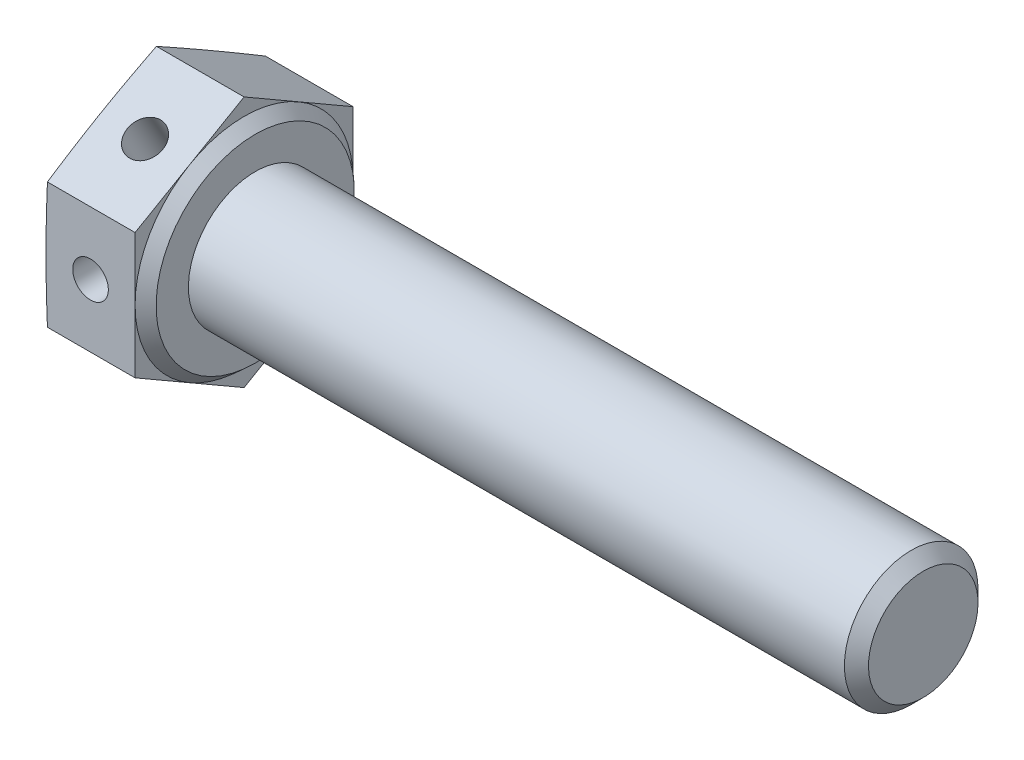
ISO-10303-21;
HEADER;
FILE_DESCRIPTION(('STEP AP214'),'2;1');
FILE_NAME('part.step','',(''),(''),'','','');
FILE_SCHEMA(('AUTOMOTIVE_DESIGN { 1 0 10303 214 1 1 1 1 }'));
ENDSEC;
DATA;
#1=APPLICATION_CONTEXT('core data for automotive mechanical design processes');
#2=APPLICATION_PROTOCOL_DEFINITION('international standard','automotive_design',2000,#1);
#3=PRODUCT_CONTEXT('',#1,'mechanical');
#4=PRODUCT('Part','Part','',(#3));
#5=PRODUCT_RELATED_PRODUCT_CATEGORY('part','',(#4));
#6=PRODUCT_DEFINITION_FORMATION('','',#4);
#7=PRODUCT_DEFINITION_CONTEXT('part definition',#1,'design');
#8=PRODUCT_DEFINITION('design','',#6,#7);
#9=PRODUCT_DEFINITION_SHAPE('','',#8);
#10=(LENGTH_UNIT() NAMED_UNIT(*) SI_UNIT(.MILLI.,.METRE.));
#11=(NAMED_UNIT(*) PLANE_ANGLE_UNIT() SI_UNIT($,.RADIAN.));
#12=(NAMED_UNIT(*) SI_UNIT($,.STERADIAN.) SOLID_ANGLE_UNIT());
#13=UNCERTAINTY_MEASURE_WITH_UNIT(LENGTH_MEASURE(1.E-05),#10,'distance_accuracy_value','');
#14=(GEOMETRIC_REPRESENTATION_CONTEXT(3) GLOBAL_UNCERTAINTY_ASSIGNED_CONTEXT((#13)) GLOBAL_UNIT_ASSIGNED_CONTEXT((#10,
#11,#12)) REPRESENTATION_CONTEXT('',''));
#15=CARTESIAN_POINT('',(0.,0.,0.));
#16=DIRECTION('',(0.,0.,1.));
#17=DIRECTION('',(1.,0.,0.));
#18=AXIS2_PLACEMENT_3D('',#15,#16,#17);
#19=CARTESIAN_POINT('',(2.,0.,-4.895));
#20=DIRECTION('',(0.,0.,1.));
#21=DIRECTION('',(1.,0.,0.));
#22=AXIS2_PLACEMENT_3D('',#19,#20,#21);
#23=CYLINDRICAL_SURFACE('',#22,0.8);
#24=CARTESIAN_POINT('',(2.,0.,4.895));
#25=DIRECTION('',(0.,0.,1.));
#26=DIRECTION('',(1.,0.,0.));
#27=AXIS2_PLACEMENT_3D('',#24,#25,#26);
#28=CIRCLE('',#27,0.8);
#29=CARTESIAN_POINT('',(2.8,0.,4.895));
#30=VERTEX_POINT('',#29);
#31=EDGE_CURVE('E385',#30,#30,#28,.T.);
#32=ORIENTED_EDGE('',*,*,#31,.T.);
#33=EDGE_LOOP('',(#32));
#34=FACE_BOUND('',#33,.T.);
#35=CARTESIAN_POINT('',(2.,0.,0.));
#36=DIRECTION('',(0.,-0.866025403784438,0.500000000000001));
#37=DIRECTION('',(0.,0.500000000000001,0.866025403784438));
#38=AXIS2_PLACEMENT_3D('',#35,#36,#37);
#39=ELLIPSE('',#38,1.6,0.8);
#40=CARTESIAN_POINT('',(1.2,0.,0.));
#41=VERTEX_POINT('',#40);
#42=CARTESIAN_POINT('',(2.8,0.,0.));
#43=VERTEX_POINT('',#42);
#44=EDGE_CURVE('E50',#41,#43,#39,.F.);
#45=ORIENTED_EDGE('',*,*,#44,.T.);
#46=CARTESIAN_POINT('',(2.,0.,0.));
#47=DIRECTION('',(0.,0.500000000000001,0.866025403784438));
#48=DIRECTION('',(0.,-0.866025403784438,0.500000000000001));
#49=AXIS2_PLACEMENT_3D('',#46,#47,#48);
#50=ELLIPSE('',#49,0.923760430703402,0.8);
#51=EDGE_CURVE('E11',#43,#41,#50,.F.);
#52=ORIENTED_EDGE('',*,*,#51,.T.);
#53=EDGE_LOOP('',(#45,#52));
#54=FACE_BOUND('',#53,.T.);
#55=ADVANCED_FACE('F37',(#34,#54),#23,.F.);
#56=CARTESIAN_POINT('',(4.5,0.,0.));
#57=DIRECTION('',(-1.,0.,0.));
#58=DIRECTION('',(0.,-1.,0.));
#59=AXIS2_PLACEMENT_3D('',#56,#57,#58);
#60=PLANE('',#59);
#61=CARTESIAN_POINT('',(4.5,0.,0.));
#62=DIRECTION('',(-1.,0.,0.));
#63=DIRECTION('',(0.,-1.,0.));
#64=AXIS2_PLACEMENT_3D('',#61,#62,#63);
#65=CIRCLE('',#64,4.45);
#66=CARTESIAN_POINT('',(4.5,-4.44999999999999,0.));
#67=VERTEX_POINT('',#66);
#68=EDGE_CURVE('E376',#67,#67,#65,.T.);
#69=ORIENTED_EDGE('',*,*,#68,.F.);
#70=EDGE_LOOP('',(#69));
#71=FACE_BOUND('',#70,.T.);
#72=CARTESIAN_POINT('',(4.5,0.,0.));
#73=DIRECTION('',(-1.,0.,0.));
#74=DIRECTION('',(0.,-1.,0.));
#75=AXIS2_PLACEMENT_3D('',#72,#73,#74);
#76=CIRCLE('',#75,3.);
#77=CARTESIAN_POINT('',(4.5,-3.,0.));
#78=VERTEX_POINT('',#77);
#79=EDGE_CURVE('E151',#78,#78,#76,.F.);
#80=ORIENTED_EDGE('',*,*,#79,.F.);
#81=EDGE_LOOP('',(#80));
#82=FACE_BOUND('',#81,.T.);
#83=ADVANCED_FACE('F332',(#71,#82),#60,.F.);
#84=CARTESIAN_POINT('',(4.,0.,9.79));
#85=DIRECTION('',(-1.,0.,0.));
#86=DIRECTION('',(0.,0.,1.));
#87=AXIS2_PLACEMENT_3D('',#84,#85,#86);
#88=PLANE('',#87);
#89=DIRECTION('',(0.,-0.5,-0.866025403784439));
#90=VECTOR('',#89,1.);
#91=CARTESIAN_POINT('',(4.,-2.82612956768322,4.895));
#92=LINE('',#91,#90);
#93=CARTESIAN_POINT('',(4.,-2.82612956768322,4.895));
#94=VERTEX_POINT('',#93);
#95=CARTESIAN_POINT('',(4.,-4.23919435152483,2.4475));
#96=VERTEX_POINT('',#95);
#97=EDGE_CURVE('E199',#94,#96,#92,.T.);
#98=ORIENTED_EDGE('',*,*,#97,.T.);
#99=CARTESIAN_POINT('',(4.,0.,0.));
#100=DIRECTION('',(-1.,0.,0.));
#101=DIRECTION('',(0.,-1.,0.));
#102=AXIS2_PLACEMENT_3D('',#99,#100,#101);
#103=CIRCLE('',#102,4.895);
#104=CARTESIAN_POINT('',(4.,0.,4.895));
#105=VERTEX_POINT('',#104);
#106=EDGE_CURVE('E58',#96,#105,#103,.T.);
#107=ORIENTED_EDGE('',*,*,#106,.T.);
#108=DIRECTION('',(0.,-1.,0.));
#109=VECTOR('',#108,1.);
#110=CARTESIAN_POINT('',(4.,2.82612956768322,4.895));
#111=LINE('',#110,#109);
#112=EDGE_CURVE('E182',#105,#94,#111,.T.);
#113=ORIENTED_EDGE('',*,*,#112,.T.);
#114=EDGE_LOOP('',(#98,#107,#113));
#115=FACE_BOUND('',#114,.T.);
#116=ADVANCED_FACE('F338',(#115),#88,.F.);
#117=CARTESIAN_POINT('',(4.,2.82612956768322,4.895));
#118=VERTEX_POINT('',#117);
#119=EDGE_CURVE('E179',#118,#105,#111,.T.);
#120=ORIENTED_EDGE('',*,*,#119,.T.);
#121=CARTESIAN_POINT('',(4.,4.23919435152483,2.4475));
#122=VERTEX_POINT('',#121);
#123=EDGE_CURVE('E154',#105,#122,#103,.T.);
#124=ORIENTED_EDGE('',*,*,#123,.T.);
#125=DIRECTION('',(0.,-0.5,0.866025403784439));
#126=VECTOR('',#125,1.);
#127=CARTESIAN_POINT('',(4.,5.65225913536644,0.));
#128=LINE('',#127,#126);
#129=EDGE_CURVE('E186',#122,#118,#128,.T.);
#130=ORIENTED_EDGE('',*,*,#129,.T.);
#131=EDGE_LOOP('',(#120,#124,#130));
#132=FACE_BOUND('',#131,.T.);
#133=ADVANCED_FACE('F508',(#132),#88,.F.);
#134=CARTESIAN_POINT('',(4.,5.65225913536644,0.));
#135=VERTEX_POINT('',#134);
#136=EDGE_CURVE('E183',#135,#122,#128,.T.);
#137=ORIENTED_EDGE('',*,*,#136,.T.);
#138=CARTESIAN_POINT('',(4.,4.23919435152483,-2.4475));
#139=VERTEX_POINT('',#138);
#140=EDGE_CURVE('E579',#122,#139,#103,.T.);
#141=ORIENTED_EDGE('',*,*,#140,.T.);
#142=DIRECTION('',(0.,0.5,0.866025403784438));
#143=VECTOR('',#142,1.);
#144=CARTESIAN_POINT('',(4.,2.82612956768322,-4.895));
#145=LINE('',#144,#143);
#146=EDGE_CURVE('E190',#139,#135,#145,.T.);
#147=ORIENTED_EDGE('',*,*,#146,.T.);
#148=EDGE_LOOP('',(#137,#141,#147));
#149=FACE_BOUND('',#148,.T.);
#150=ADVANCED_FACE('F499',(#149),#88,.F.);
#151=CARTESIAN_POINT('',(4.,2.82612956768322,-4.895));
#152=VERTEX_POINT('',#151);
#153=EDGE_CURVE('E187',#152,#139,#145,.T.);
#154=ORIENTED_EDGE('',*,*,#153,.T.);
#155=CARTESIAN_POINT('',(4.,0.,-4.895));
#156=VERTEX_POINT('',#155);
#157=EDGE_CURVE('E577',#139,#156,#103,.T.);
#158=ORIENTED_EDGE('',*,*,#157,.T.);
#159=DIRECTION('',(0.,1.,0.));
#160=VECTOR('',#159,1.);
#161=CARTESIAN_POINT('',(4.,-2.82612956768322,-4.895));
#162=LINE('',#161,#160);
#163=EDGE_CURVE('E194',#156,#152,#162,.T.);
#164=ORIENTED_EDGE('',*,*,#163,.T.);
#165=EDGE_LOOP('',(#154,#158,#164));
#166=FACE_BOUND('',#165,.T.);
#167=ADVANCED_FACE('F489',(#166),#88,.F.);
#168=CARTESIAN_POINT('',(4.,-2.82612956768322,-4.895));
#169=VERTEX_POINT('',#168);
#170=EDGE_CURVE('E191',#169,#156,#162,.T.);
#171=ORIENTED_EDGE('',*,*,#170,.T.);
#172=CARTESIAN_POINT('',(4.,-4.23919435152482,-2.4475));
#173=VERTEX_POINT('',#172);
#174=EDGE_CURVE('E576',#156,#173,#103,.T.);
#175=ORIENTED_EDGE('',*,*,#174,.T.);
#176=DIRECTION('',(0.,0.5,-0.866025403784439));
#177=VECTOR('',#176,1.);
#178=CARTESIAN_POINT('',(4.,-5.65225913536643,0.));
#179=LINE('',#178,#177);
#180=EDGE_CURVE('E198',#173,#169,#179,.T.);
#181=ORIENTED_EDGE('',*,*,#180,.T.);
#182=EDGE_LOOP('',(#171,#175,#181));
#183=FACE_BOUND('',#182,.T.);
#184=ADVANCED_FACE('F239',(#183),#88,.F.);
#185=CARTESIAN_POINT('',(4.,-2.82612956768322,4.895));
#186=DIRECTION('',(0.,0.866025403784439,-0.5));
#187=DIRECTION('',(0.,0.5,0.866025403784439));
#188=AXIS2_PLACEMENT_3D('',#185,#186,#187);
#189=PLANE('',#188);
#190=CARTESIAN_POINT('',(0.0648633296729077,-5.65237460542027,-0.000199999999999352));
#191=CARTESIAN_POINT('',(0.0547762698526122,-5.53465016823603,0.203704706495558));
#192=CARTESIAN_POINT('',(0.0456389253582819,-5.41690358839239,0.407647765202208));
#193=CARTESIAN_POINT('',(0.0296091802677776,-5.18136784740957,0.815607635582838));
#194=CARTESIAN_POINT('',(0.0227168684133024,-5.06357868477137,1.0196244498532));
#195=CARTESIAN_POINT('',(0.0115265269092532,-4.82803136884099,1.42760436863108));
#196=CARTESIAN_POINT('',(0.00722712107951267,-4.71027323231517,1.63156744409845));
#197=CARTESIAN_POINT('',(0.00146388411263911,-4.47474151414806,2.03952034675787));
#198=CARTESIAN_POINT('',(0.,-4.35696793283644,2.24351017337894));
#199=CARTESIAN_POINT('',(0.,-4.12142077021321,2.65148982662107));
#200=CARTESIAN_POINT('',(0.00146388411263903,-4.00364718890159,2.85547965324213));
#201=CARTESIAN_POINT('',(0.00722712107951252,-3.76811547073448,3.26343255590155));
#202=CARTESIAN_POINT('',(0.011526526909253,-3.65035733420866,3.46739563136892));
#203=CARTESIAN_POINT('',(0.0227168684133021,-3.41481001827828,3.8753755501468));
#204=CARTESIAN_POINT('',(0.0296091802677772,-3.29702085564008,4.07939236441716));
#205=CARTESIAN_POINT('',(0.0456389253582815,-3.06148511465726,4.48735223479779));
#206=CARTESIAN_POINT('',(0.0547762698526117,-2.94373853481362,4.69129529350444));
#207=CARTESIAN_POINT('',(0.0648633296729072,-2.82601409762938,4.8952));
#208=B_SPLINE_CURVE_WITH_KNOTS('',3,(#190,#191,#192,#193,#194,#195,#196,#197,#198,#199,#200,
#201,#202,#203,#204,#205,#206,#207),.UNSPECIFIED.,.F.,.F.,(4,2,2,2,2,2,2,2,4),(0.,
0.706998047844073,1.41402403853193,2.12067444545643,2.82731165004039,3.53394885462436,
4.24059926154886,4.94762525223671,5.65462330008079),.UNSPECIFIED.);
#209=CARTESIAN_POINT('',(0.06485344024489,-5.65225913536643,0.));
#210=VERTEX_POINT('',#209);
#211=CARTESIAN_POINT('',(0.,-4.23919435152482,2.4475));
#212=VERTEX_POINT('',#211);
#213=EDGE_CURVE('E248',#210,#212,#208,.T.);
#214=ORIENTED_EDGE('',*,*,#213,.F.);
#215=DIRECTION('',(-1.,0.,0.));
#216=VECTOR('',#215,1.);
#217=CARTESIAN_POINT('',(4.,-5.65225913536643,0.));
#218=LINE('',#217,#216);
#219=CARTESIAN_POINT('',(4.,-5.65225913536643,0.));
#220=VERTEX_POINT('',#219);
#221=EDGE_CURVE('E161',#220,#210,#218,.T.);
#222=ORIENTED_EDGE('',*,*,#221,.F.);
#223=EDGE_CURVE('E202',#96,#220,#92,.T.);
#224=ORIENTED_EDGE('',*,*,#223,.F.);
#225=ORIENTED_EDGE('',*,*,#97,.F.);
#226=DIRECTION('',(-1.,0.,0.));
#227=VECTOR('',#226,1.);
#228=CARTESIAN_POINT('',(4.,-2.82612956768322,4.895));
#229=LINE('',#228,#227);
#230=CARTESIAN_POINT('',(0.0648534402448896,-2.82612956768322,4.895));
#231=VERTEX_POINT('',#230);
#232=EDGE_CURVE('E176',#94,#231,#229,.T.);
#233=ORIENTED_EDGE('',*,*,#232,.T.);
#234=EDGE_CURVE('E242',#212,#231,#208,.T.);
#235=ORIENTED_EDGE('',*,*,#234,.F.);
#236=EDGE_LOOP('',(#214,#222,#224,#225,#233,#235));
#237=FACE_BOUND('',#236,.T.);
#238=ADVANCED_FACE('F235',(#237),#189,.F.);
#239=CARTESIAN_POINT('',(4.,-5.65225913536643,0.));
#240=DIRECTION('',(0.,0.866025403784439,0.5));
#241=DIRECTION('',(0.,-0.5,0.866025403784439));
#242=AXIS2_PLACEMENT_3D('',#239,#240,#241);
#243=PLANE('',#242);
#244=CARTESIAN_POINT('',(2.,-4.23919435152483,-2.44749999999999));
#245=DIRECTION('',(0.,0.866025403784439,0.5));
#246=DIRECTION('',(0.,-0.5,0.866025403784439));
#247=AXIS2_PLACEMENT_3D('',#244,#245,#246);
#248=CIRCLE('',#247,0.8);
#249=CARTESIAN_POINT('',(2.,-4.63919435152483,-1.75467967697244));
#250=VERTEX_POINT('',#249);
#251=EDGE_CURVE('E387',#250,#250,#248,.T.);
#252=ORIENTED_EDGE('',*,*,#251,.T.);
#253=EDGE_LOOP('',(#252));
#254=FACE_BOUND('',#253,.T.);
#255=CARTESIAN_POINT('',(0.0648633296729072,-2.82601409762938,-4.8952));
#256=CARTESIAN_POINT('',(0.0547762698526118,-2.94373853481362,-4.69129529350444));
#257=CARTESIAN_POINT('',(0.0456389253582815,-3.06148511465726,-4.48735223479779));
#258=CARTESIAN_POINT('',(0.0296091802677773,-3.29702085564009,-4.07939236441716));
#259=CARTESIAN_POINT('',(0.0227168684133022,-3.41481001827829,-3.8753755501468));
#260=CARTESIAN_POINT('',(0.0115265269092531,-3.65035733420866,-3.46739563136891));
#261=CARTESIAN_POINT('',(0.00722712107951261,-3.76811547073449,-3.26343255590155));
#262=CARTESIAN_POINT('',(0.00146388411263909,-4.00364718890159,-2.85547965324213));
#263=CARTESIAN_POINT('',(0.,-4.12142077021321,-2.65148982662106));
#264=CARTESIAN_POINT('',(0.,-4.35696793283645,-2.24351017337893));
#265=CARTESIAN_POINT('',(0.00146388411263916,-4.47474151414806,-2.03952034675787));
#266=CARTESIAN_POINT('',(0.00722712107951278,-4.71027323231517,-1.63156744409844));
#267=CARTESIAN_POINT('',(0.0115265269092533,-4.828031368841,-1.42760436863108));
#268=CARTESIAN_POINT('',(0.0227168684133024,-5.06357868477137,-1.01962444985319));
#269=CARTESIAN_POINT('',(0.0296091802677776,-5.18136784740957,-0.815607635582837));
#270=CARTESIAN_POINT('',(0.0456389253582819,-5.41690358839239,-0.407647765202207));
#271=CARTESIAN_POINT('',(0.0547762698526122,-5.53465016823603,-0.203704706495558));
#272=CARTESIAN_POINT('',(0.0648633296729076,-5.65237460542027,0.000200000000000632));
#273=B_SPLINE_CURVE_WITH_KNOTS('',3,(#255,#256,#257,#258,#259,#260,#261,#262,#263,#264,#265,
#266,#267,#268,#269,#270,#271,#272),.UNSPECIFIED.,.F.,.F.,(4,2,2,2,2,2,2,2,4),(0.,
0.706998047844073,1.41402403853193,2.12067444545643,2.82731165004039,3.53394885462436,
4.24059926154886,4.94762525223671,5.65462330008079),.UNSPECIFIED.);
#274=CARTESIAN_POINT('',(0.0648534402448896,-2.82612956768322,-4.895));
#275=VERTEX_POINT('',#274);
#276=CARTESIAN_POINT('',(0.,-4.23919435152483,-2.44749999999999));
#277=VERTEX_POINT('',#276);
#278=EDGE_CURVE('E265',#275,#277,#273,.T.);
#279=ORIENTED_EDGE('',*,*,#278,.F.);
#280=DIRECTION('',(-1.,0.,0.));
#281=VECTOR('',#280,1.);
#282=CARTESIAN_POINT('',(4.,-2.82612956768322,-4.895));
#283=LINE('',#282,#281);
#284=EDGE_CURVE('E164',#169,#275,#283,.T.);
#285=ORIENTED_EDGE('',*,*,#284,.F.);
#286=ORIENTED_EDGE('',*,*,#180,.F.);
#287=EDGE_CURVE('E195',#220,#173,#179,.T.);
#288=ORIENTED_EDGE('',*,*,#287,.F.);
#289=ORIENTED_EDGE('',*,*,#221,.T.);
#290=EDGE_CURVE('E213',#277,#210,#273,.T.);
#291=ORIENTED_EDGE('',*,*,#290,.F.);
#292=EDGE_LOOP('',(#279,#285,#286,#288,#289,#291));
#293=FACE_BOUND('',#292,.T.);
#294=ADVANCED_FACE('F229',(#254,#293),#243,.F.);
#295=CARTESIAN_POINT('',(4.,-2.82612956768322,-4.895));
#296=DIRECTION('',(0.,0.,1.));
#297=DIRECTION('',(1.,0.,0.));
#298=AXIS2_PLACEMENT_3D('',#295,#296,#297);
#299=PLANE('',#298);
#300=CARTESIAN_POINT('',(2.,0.,-4.895));
#301=DIRECTION('',(0.,0.,1.));
#302=DIRECTION('',(1.,0.,0.));
#303=AXIS2_PLACEMENT_3D('',#300,#301,#302);
#304=CIRCLE('',#303,0.8);
#305=CARTESIAN_POINT('',(2.8,0.,-4.895));
#306=VERTEX_POINT('',#305);
#307=EDGE_CURVE('E380',#306,#306,#304,.T.);
#308=ORIENTED_EDGE('',*,*,#307,.T.);
#309=EDGE_LOOP('',(#308));
#310=FACE_BOUND('',#309,.T.);
#311=CARTESIAN_POINT('',(0.344641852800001,-7.45594376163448,-4.895));
#312=CARTESIAN_POINT('',(0.328733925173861,-7.23370732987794,-4.895));
#313=CARTESIAN_POINT('',(0.313033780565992,-7.01145601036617,-4.895));
#314=CARTESIAN_POINT('',(0.28215153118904,-6.56691638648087,-4.895));
#315=CARTESIAN_POINT('',(0.266969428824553,-6.34462808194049,-4.895));
#316=CARTESIAN_POINT('',(0.222351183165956,-5.67765612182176,-4.895));
#317=CARTESIAN_POINT('',(0.1938462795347,-5.23290925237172,-4.895));
#318=CARTESIAN_POINT('',(0.14058500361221,-4.34353448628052,-4.895));
#319=CARTESIAN_POINT('',(0.115825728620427,-3.89890676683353,-4.895));
#320=CARTESIAN_POINT('',(0.0719027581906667,-3.00937528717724,-4.895));
#321=CARTESIAN_POINT('',(0.0527389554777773,-2.56447153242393,-4.895));
#322=CARTESIAN_POINT('',(0.022461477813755,-1.67389262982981,-4.895));
#323=CARTESIAN_POINT('',(0.011356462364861,-1.22821716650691,-4.895));
#324=CARTESIAN_POINT('',(0.00230531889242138,-0.559612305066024,-4.895));
#325=CARTESIAN_POINT('',(0.000555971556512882,-0.336731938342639,-4.895));
#326=CARTESIAN_POINT('',(-0.000329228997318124,0.109034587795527,-4.895));
#327=CARTESIAN_POINT('',(0.000534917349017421,0.331920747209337,-4.895));
#328=CARTESIAN_POINT('',(0.0048338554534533,0.777749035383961,-4.895));
#329=CARTESIAN_POINT('',(0.00826958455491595,1.00069115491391,-4.895));
#330=CARTESIAN_POINT('',(0.017528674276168,1.44652652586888,-4.895));
#331=CARTESIAN_POINT('',(0.0233520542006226,1.66941977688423,-4.895));
#332=CARTESIAN_POINT('',(0.0439977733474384,2.33802188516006,-4.895));
#333=CARTESIAN_POINT('',(0.0619954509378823,2.78363280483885,-4.895));
#334=CARTESIAN_POINT('',(0.102984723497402,3.65297083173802,-4.895));
#335=CARTESIAN_POINT('',(0.125692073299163,4.07671204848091,-4.895));
#336=CARTESIAN_POINT('',(0.174805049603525,4.92398356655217,-4.895));
#337=CARTESIAN_POINT('',(0.201210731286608,5.34751386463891,-4.895));
#338=CARTESIAN_POINT('',(0.256525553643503,6.19442494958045,-4.895));
#339=CARTESIAN_POINT('',(0.285434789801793,6.61780573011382,-4.895));
#340=CARTESIAN_POINT('',(0.344971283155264,7.46444680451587,-4.895));
#341=CARTESIAN_POINT('',(0.375598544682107,7.88770709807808,-4.895));
#342=CARTESIAN_POINT('',(0.438029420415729,8.73371331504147,-4.895));
#343=CARTESIAN_POINT('',(0.469831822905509,9.15645932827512,-4.895));
#344=CARTESIAN_POINT('',(0.534306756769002,10.0018857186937,-4.895));
#345=CARTESIAN_POINT('',(0.566979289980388,10.4245660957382,-4.895));
#346=CARTESIAN_POINT('',(0.632959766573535,11.2698086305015,-4.895));
#347=CARTESIAN_POINT('',(0.666267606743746,11.6923707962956,-4.895));
#348=CARTESIAN_POINT('',(0.733376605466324,12.5374543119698,-4.895));
#349=CARTESIAN_POINT('',(0.767177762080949,12.9599756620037,-4.895));
#350=CARTESIAN_POINT('',(0.801152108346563,13.3824829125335,-4.895));
#351=B_SPLINE_CURVE_WITH_KNOTS('',3,(#311,#312,#313,#314,#315,#316,#317,#318,#319,#320,#321,
#322,#323,#324,#325,#326,#327,#328,#329,#330,#331,#332,#333,#334,#335,#336,#337,#338,#339,#340,
#341,#342,#343,#344,#345,#346,#347,#348,#349,#350),.UNSPECIFIED.,.F.,.F.,(4,2,2,2,2,2,2,2,2,2,2,
2,2,2,2,2,2,2,2,4),(0.,0.668414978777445,1.33683305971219,2.67380106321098,4.00972760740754,
5.34562853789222,6.68296283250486,7.35161079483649,8.02025864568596,8.68915033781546,
9.35804743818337,10.6959025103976,11.9689301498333,13.2419767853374,14.5150719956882,
15.7881704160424,17.0599908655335,18.3318140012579,19.6034322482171,20.875045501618),.UNSPECIFIED.);
#352=CARTESIAN_POINT('',(0.064853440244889,2.82612956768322,-4.895));
#353=VERTEX_POINT('',#352);
#354=CARTESIAN_POINT('',(0.,0.,-4.895));
#355=VERTEX_POINT('',#354);
#356=EDGE_CURVE('E211',#353,#355,#351,.F.);
#357=ORIENTED_EDGE('',*,*,#356,.F.);
#358=DIRECTION('',(-1.,0.,0.));
#359=VECTOR('',#358,1.);
#360=CARTESIAN_POINT('',(4.,2.82612956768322,-4.895));
#361=LINE('',#360,#359);
#362=EDGE_CURVE('E167',#152,#353,#361,.T.);
#363=ORIENTED_EDGE('',*,*,#362,.F.);
#364=ORIENTED_EDGE('',*,*,#163,.F.);
#365=ORIENTED_EDGE('',*,*,#170,.F.);
#366=ORIENTED_EDGE('',*,*,#284,.T.);
#367=EDGE_CURVE('E203',#355,#275,#351,.F.);
#368=ORIENTED_EDGE('',*,*,#367,.F.);
#369=EDGE_LOOP('',(#357,#363,#364,#365,#366,#368));
#370=FACE_BOUND('',#369,.T.);
#371=ADVANCED_FACE('F224',(#310,#370),#299,.F.);
#372=CARTESIAN_POINT('',(4.,2.82612956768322,-4.895));
#373=DIRECTION('',(0.,-0.866025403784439,0.5));
#374=DIRECTION('',(0.,-0.5,-0.866025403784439));
#375=AXIS2_PLACEMENT_3D('',#372,#373,#374);
#376=PLANE('',#375);
#377=CARTESIAN_POINT('',(0.064863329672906,5.65237460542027,0.000199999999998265));
#378=CARTESIAN_POINT('',(0.0547762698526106,5.53465016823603,-0.20370470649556));
#379=CARTESIAN_POINT('',(0.0456389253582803,5.41690358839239,-0.40764776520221));
#380=CARTESIAN_POINT('',(0.0296091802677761,5.18136784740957,-0.815607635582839));
#381=CARTESIAN_POINT('',(0.0227168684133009,5.06357868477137,-1.0196244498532));
#382=CARTESIAN_POINT('',(0.0115265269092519,4.828031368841,-1.42760436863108));
#383=CARTESIAN_POINT('',(0.00722712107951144,4.71027323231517,-1.63156744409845));
#384=CARTESIAN_POINT('',(0.00146388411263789,4.47474151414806,-2.03952034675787));
#385=CARTESIAN_POINT('',(0.,4.35696793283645,-2.24351017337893));
#386=CARTESIAN_POINT('',(0.,4.12142077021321,-2.65148982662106));
#387=CARTESIAN_POINT('',(0.001463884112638,4.00364718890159,-2.85547965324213));
#388=CARTESIAN_POINT('',(0.00722712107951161,3.76811547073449,-3.26343255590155));
#389=CARTESIAN_POINT('',(0.0115265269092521,3.65035733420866,-3.46739563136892));
#390=CARTESIAN_POINT('',(0.0227168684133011,3.41481001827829,-3.8753755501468));
#391=CARTESIAN_POINT('',(0.0296091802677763,3.29702085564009,-4.07939236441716));
#392=CARTESIAN_POINT('',(0.0456389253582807,3.06148511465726,-4.48735223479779));
#393=CARTESIAN_POINT('',(0.054776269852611,2.94373853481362,-4.69129529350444));
#394=CARTESIAN_POINT('',(0.0648633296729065,2.82601409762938,-4.8952));
#395=B_SPLINE_CURVE_WITH_KNOTS('',3,(#377,#378,#379,#380,#381,#382,#383,#384,#385,#386,#387,
#388,#389,#390,#391,#392,#393,#394),.UNSPECIFIED.,.F.,.F.,(4,2,2,2,2,2,2,2,4),(0.,
0.706998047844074,1.41402403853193,2.12067444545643,2.82731165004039,3.53394885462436,
4.24059926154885,4.94762525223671,5.65462330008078),.UNSPECIFIED.);
#396=CARTESIAN_POINT('',(0.0648534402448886,5.65225913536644,0.));
#397=VERTEX_POINT('',#396);
#398=CARTESIAN_POINT('',(0.,4.23919435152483,-2.44749999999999));
#399=VERTEX_POINT('',#398);
#400=EDGE_CURVE('E255',#397,#399,#395,.T.);
#401=ORIENTED_EDGE('',*,*,#400,.F.);
#402=DIRECTION('',(-1.,0.,0.));
#403=VECTOR('',#402,1.);
#404=CARTESIAN_POINT('',(4.,5.65225913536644,0.));
#405=LINE('',#404,#403);
#406=EDGE_CURVE('E170',#135,#397,#405,.T.);
#407=ORIENTED_EDGE('',*,*,#406,.F.);
#408=ORIENTED_EDGE('',*,*,#146,.F.);
#409=ORIENTED_EDGE('',*,*,#153,.F.);
#410=ORIENTED_EDGE('',*,*,#362,.T.);
#411=EDGE_CURVE('E212',#399,#353,#395,.T.);
#412=ORIENTED_EDGE('',*,*,#411,.F.);
#413=EDGE_LOOP('',(#401,#407,#408,#409,#410,#412));
#414=FACE_BOUND('',#413,.T.);
#415=ADVANCED_FACE('F228',(#414),#376,.F.);
#416=CARTESIAN_POINT('',(4.,5.65225913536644,0.));
#417=DIRECTION('',(0.,-0.866025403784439,-0.5));
#418=DIRECTION('',(0.,0.5,-0.866025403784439));
#419=AXIS2_PLACEMENT_3D('',#416,#417,#418);
#420=PLANE('',#419);
#421=CARTESIAN_POINT('',(2.,4.23919435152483,2.44749999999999));
#422=DIRECTION('',(0.,-0.866025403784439,-0.5));
#423=DIRECTION('',(0.,0.5,-0.866025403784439));
#424=AXIS2_PLACEMENT_3D('',#421,#422,#423);
#425=CIRCLE('',#424,0.8);
#426=CARTESIAN_POINT('',(2.,4.63919435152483,1.75467967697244));
#427=VERTEX_POINT('',#426);
#428=EDGE_CURVE('E390',#427,#427,#425,.T.);
#429=ORIENTED_EDGE('',*,*,#428,.T.);
#430=EDGE_LOOP('',(#429));
#431=FACE_BOUND('',#430,.T.);
#432=CARTESIAN_POINT('',(0.0648633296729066,2.82601409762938,4.8952));
#433=CARTESIAN_POINT('',(0.0547762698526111,2.94373853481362,4.69129529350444));
#434=CARTESIAN_POINT('',(0.0456389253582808,3.06148511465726,4.48735223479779));
#435=CARTESIAN_POINT('',(0.0296091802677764,3.29702085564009,4.07939236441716));
#436=CARTESIAN_POINT('',(0.0227168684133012,3.41481001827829,3.8753755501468));
#437=CARTESIAN_POINT('',(0.0115265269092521,3.65035733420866,3.46739563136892));
#438=CARTESIAN_POINT('',(0.0072271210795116,3.76811547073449,3.26343255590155));
#439=CARTESIAN_POINT('',(0.00146388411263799,4.00364718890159,2.85547965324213));
#440=CARTESIAN_POINT('',(0.,4.12142077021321,2.65148982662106));
#441=CARTESIAN_POINT('',(0.,4.35696793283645,2.24351017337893));
#442=CARTESIAN_POINT('',(0.00146388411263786,4.47474151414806,2.03952034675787));
#443=CARTESIAN_POINT('',(0.00722712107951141,4.71027323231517,1.63156744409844));
#444=CARTESIAN_POINT('',(0.0115265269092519,4.828031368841,1.42760436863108));
#445=CARTESIAN_POINT('',(0.022716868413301,5.06357868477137,1.0196244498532));
#446=CARTESIAN_POINT('',(0.0296091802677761,5.18136784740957,0.815607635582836));
#447=CARTESIAN_POINT('',(0.0456389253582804,5.41690358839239,0.407647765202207));
#448=CARTESIAN_POINT('',(0.0547762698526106,5.53465016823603,0.203704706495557));
#449=CARTESIAN_POINT('',(0.0648633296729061,5.65237460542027,-0.000200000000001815));
#450=B_SPLINE_CURVE_WITH_KNOTS('',3,(#432,#433,#434,#435,#436,#437,#438,#439,#440,#441,#442,
#443,#444,#445,#446,#447,#448,#449),.UNSPECIFIED.,.F.,.F.,(4,2,2,2,2,2,2,2,4),(0.,
0.706998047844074,1.41402403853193,2.12067444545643,2.82731165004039,3.53394885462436,
4.24059926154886,4.94762525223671,5.65462330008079),.UNSPECIFIED.);
#451=CARTESIAN_POINT('',(0.0648534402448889,2.82612956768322,4.895));
#452=VERTEX_POINT('',#451);
#453=CARTESIAN_POINT('',(0.,4.23919435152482,2.4475));
#454=VERTEX_POINT('',#453);
#455=EDGE_CURVE('E249',#452,#454,#450,.T.);
#456=ORIENTED_EDGE('',*,*,#455,.F.);
#457=DIRECTION('',(-1.,0.,0.));
#458=VECTOR('',#457,1.);
#459=CARTESIAN_POINT('',(4.,2.82612956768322,4.895));
#460=LINE('',#459,#458);
#461=EDGE_CURVE('E173',#118,#452,#460,.T.);
#462=ORIENTED_EDGE('',*,*,#461,.F.);
#463=ORIENTED_EDGE('',*,*,#129,.F.);
#464=ORIENTED_EDGE('',*,*,#136,.F.);
#465=ORIENTED_EDGE('',*,*,#406,.T.);
#466=EDGE_CURVE('E260',#454,#397,#450,.T.);
#467=ORIENTED_EDGE('',*,*,#466,.F.);
#468=EDGE_LOOP('',(#456,#462,#463,#464,#465,#467));
#469=FACE_BOUND('',#468,.T.);
#470=ADVANCED_FACE('F320',(#431,#469),#420,.F.);
#471=CARTESIAN_POINT('',(4.,2.82612956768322,4.895));
#472=DIRECTION('',(0.,0.,-1.));
#473=DIRECTION('',(-1.,0.,0.));
#474=AXIS2_PLACEMENT_3D('',#471,#472,#473);
#475=PLANE('',#474);
#476=ORIENTED_EDGE('',*,*,#31,.F.);
#477=EDGE_LOOP('',(#476));
#478=FACE_BOUND('',#477,.T.);
#479=CARTESIAN_POINT('',(0.344641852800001,-7.45594376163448,4.895));
#480=CARTESIAN_POINT('',(0.328733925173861,-7.23370732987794,4.895));
#481=CARTESIAN_POINT('',(0.313033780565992,-7.01145601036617,4.895));
#482=CARTESIAN_POINT('',(0.28215153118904,-6.56691638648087,4.895));
#483=CARTESIAN_POINT('',(0.266969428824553,-6.34462808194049,4.895));
#484=CARTESIAN_POINT('',(0.222351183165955,-5.67765612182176,4.895));
#485=CARTESIAN_POINT('',(0.1938462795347,-5.23290925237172,4.895));
#486=CARTESIAN_POINT('',(0.14058500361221,-4.34353448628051,4.895));
#487=CARTESIAN_POINT('',(0.115825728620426,-3.89890676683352,4.895));
#488=CARTESIAN_POINT('',(0.0719027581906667,-3.00937528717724,4.895));
#489=CARTESIAN_POINT('',(0.0527389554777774,-2.56447153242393,4.895));
#490=CARTESIAN_POINT('',(0.0224614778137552,-1.6738926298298,4.895));
#491=CARTESIAN_POINT('',(0.0113564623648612,-1.22821716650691,4.895));
#492=CARTESIAN_POINT('',(0.0023053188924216,-0.559612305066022,4.895));
#493=CARTESIAN_POINT('',(0.000555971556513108,-0.336731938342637,4.895));
#494=CARTESIAN_POINT('',(-0.000329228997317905,0.109034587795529,4.895));
#495=CARTESIAN_POINT('',(0.000534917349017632,0.331920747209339,4.895));
#496=CARTESIAN_POINT('',(0.00483385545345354,0.777749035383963,4.895));
#497=CARTESIAN_POINT('',(0.00826958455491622,1.00069115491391,4.895));
#498=CARTESIAN_POINT('',(0.0175286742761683,1.44652652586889,4.895));
#499=CARTESIAN_POINT('',(0.0233520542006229,1.66941977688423,4.895));
#500=CARTESIAN_POINT('',(0.0439977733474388,2.33802188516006,4.895));
#501=CARTESIAN_POINT('',(0.0619954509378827,2.78363280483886,4.895));
#502=CARTESIAN_POINT('',(0.102984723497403,3.65297083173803,4.895));
#503=CARTESIAN_POINT('',(0.125692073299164,4.07671204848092,4.895));
#504=CARTESIAN_POINT('',(0.174805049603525,4.92398356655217,4.895));
#505=CARTESIAN_POINT('',(0.201210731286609,5.34751386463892,4.895));
#506=CARTESIAN_POINT('',(0.256525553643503,6.19442494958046,4.895));
#507=CARTESIAN_POINT('',(0.285434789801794,6.61780573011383,4.895));
#508=CARTESIAN_POINT('',(0.344971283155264,7.46444680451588,4.895));
#509=CARTESIAN_POINT('',(0.375598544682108,7.88770709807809,4.895));
#510=CARTESIAN_POINT('',(0.43802942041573,8.73371331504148,4.895));
#511=CARTESIAN_POINT('',(0.469831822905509,9.15645932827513,4.895));
#512=CARTESIAN_POINT('',(0.534306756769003,10.0018857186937,4.895));
#513=CARTESIAN_POINT('',(0.566979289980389,10.4245660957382,4.895));
#514=CARTESIAN_POINT('',(0.632959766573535,11.2698086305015,4.895));
#515=CARTESIAN_POINT('',(0.666267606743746,11.6923707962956,4.895));
#516=CARTESIAN_POINT('',(0.733376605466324,12.5374543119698,4.895));
#517=CARTESIAN_POINT('',(0.767177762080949,12.9599756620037,4.895));
#518=CARTESIAN_POINT('',(0.801152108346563,13.3824829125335,4.895));
#519=B_SPLINE_CURVE_WITH_KNOTS('',3,(#479,#480,#481,#482,#483,#484,#485,#486,#487,#488,#489,
#490,#491,#492,#493,#494,#495,#496,#497,#498,#499,#500,#501,#502,#503,#504,#505,#506,#507,#508,
#509,#510,#511,#512,#513,#514,#515,#516,#517,#518),.UNSPECIFIED.,.F.,.F.,(4,2,2,2,2,2,2,2,2,2,2,
2,2,2,2,2,2,2,2,4),(0.,0.668414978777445,1.3368330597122,2.67380106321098,4.00972760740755,
5.34562853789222,6.68296283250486,7.35161079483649,8.02025864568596,8.68915033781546,
9.35804743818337,10.6959025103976,11.9689301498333,13.2419767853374,14.5150719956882,
15.7881704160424,17.0599908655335,18.3318140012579,19.6034322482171,20.875045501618),.UNSPECIFIED.);
#520=CARTESIAN_POINT('',(0.,0.,4.895));
#521=VERTEX_POINT('',#520);
#522=EDGE_CURVE('E301',#231,#521,#519,.T.);
#523=ORIENTED_EDGE('',*,*,#522,.F.);
#524=ORIENTED_EDGE('',*,*,#232,.F.);
#525=ORIENTED_EDGE('',*,*,#112,.F.);
#526=ORIENTED_EDGE('',*,*,#119,.F.);
#527=ORIENTED_EDGE('',*,*,#461,.T.);
#528=EDGE_CURVE('E308',#521,#452,#519,.T.);
#529=ORIENTED_EDGE('',*,*,#528,.F.);
#530=EDGE_LOOP('',(#523,#524,#525,#526,#527,#529));
#531=FACE_BOUND('',#530,.T.);
#532=ADVANCED_FACE('F306',(#478,#531),#475,.F.);
#533=ORIENTED_EDGE('',*,*,#287,.T.);
#534=EDGE_CURVE('E158',#173,#96,#103,.T.);
#535=ORIENTED_EDGE('',*,*,#534,.T.);
#536=ORIENTED_EDGE('',*,*,#223,.T.);
#537=EDGE_LOOP('',(#533,#535,#536));
#538=FACE_BOUND('',#537,.T.);
#539=ADVANCED_FACE('F319',(#538),#88,.F.);
#540=CARTESIAN_POINT('',(0.,0.,0.));
#541=DIRECTION('',(1.,0.,0.));
#542=DIRECTION('',(0.,1.,0.));
#543=AXIS2_PLACEMENT_3D('',#540,#541,#542);
#544=CONICAL_SURFACE('',#543,4.895,1.48536245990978);
#545=ORIENTED_EDGE('',*,*,#234,.T.);
#546=ORIENTED_EDGE('',*,*,#522,.T.);
#547=CARTESIAN_POINT('',(0.,0.,0.));
#548=DIRECTION('',(-1.,0.,0.));
#549=DIRECTION('',(0.,-1.,0.));
#550=AXIS2_PLACEMENT_3D('',#547,#548,#549);
#551=CIRCLE('',#550,4.895);
#552=EDGE_CURVE('E303',#212,#521,#551,.T.);
#553=ORIENTED_EDGE('',*,*,#552,.F.);
#554=EDGE_LOOP('',(#545,#546,#553));
#555=FACE_BOUND('',#554,.T.);
#556=ADVANCED_FACE('F300',(#555),#544,.T.);
#557=ORIENTED_EDGE('',*,*,#290,.T.);
#558=ORIENTED_EDGE('',*,*,#213,.T.);
#559=CARTESIAN_POINT('',(0.,0.,0.));
#560=DIRECTION('',(-1.,0.,0.));
#561=DIRECTION('',(0.,0.,1.));
#562=AXIS2_PLACEMENT_3D('',#559,#560,#561);
#563=CIRCLE('',#562,4.895);
#564=EDGE_CURVE('E160',#277,#212,#563,.T.);
#565=ORIENTED_EDGE('',*,*,#564,.F.);
#566=EDGE_LOOP('',(#557,#558,#565));
#567=FACE_BOUND('',#566,.T.);
#568=ADVANCED_FACE('F283',(#567),#544,.T.);
#569=ORIENTED_EDGE('',*,*,#367,.T.);
#570=ORIENTED_EDGE('',*,*,#278,.T.);
#571=EDGE_CURVE('E275',#355,#277,#563,.T.);
#572=ORIENTED_EDGE('',*,*,#571,.F.);
#573=EDGE_LOOP('',(#569,#570,#572));
#574=FACE_BOUND('',#573,.T.);
#575=ADVANCED_FACE('F273',(#574),#544,.T.);
#576=ORIENTED_EDGE('',*,*,#356,.T.);
#577=EDGE_CURVE('E290',#399,#355,#563,.T.);
#578=ORIENTED_EDGE('',*,*,#577,.F.);
#579=ORIENTED_EDGE('',*,*,#411,.T.);
#580=EDGE_LOOP('',(#576,#578,#579));
#581=FACE_BOUND('',#580,.T.);
#582=ADVANCED_FACE('F220',(#581),#544,.T.);
#583=ORIENTED_EDGE('',*,*,#400,.T.);
#584=EDGE_CURVE('E159',#454,#399,#563,.T.);
#585=ORIENTED_EDGE('',*,*,#584,.F.);
#586=ORIENTED_EDGE('',*,*,#466,.T.);
#587=EDGE_LOOP('',(#583,#585,#586));
#588=FACE_BOUND('',#587,.T.);
#589=ADVANCED_FACE('F536',(#588),#544,.T.);
#590=ORIENTED_EDGE('',*,*,#455,.T.);
#591=EDGE_CURVE('E155',#521,#454,#563,.T.);
#592=ORIENTED_EDGE('',*,*,#591,.F.);
#593=ORIENTED_EDGE('',*,*,#528,.T.);
#594=EDGE_LOOP('',(#590,#592,#593));
#595=FACE_BOUND('',#594,.T.);
#596=ADVANCED_FACE('F372',(#595),#544,.T.);
#597=CARTESIAN_POINT('',(0.,0.,9.79));
#598=DIRECTION('',(-1.,0.,0.));
#599=DIRECTION('',(0.,0.,1.));
#600=AXIS2_PLACEMENT_3D('',#597,#598,#599);
#601=PLANE('',#600);
#602=ORIENTED_EDGE('',*,*,#552,.T.);
#603=ORIENTED_EDGE('',*,*,#591,.T.);
#604=ORIENTED_EDGE('',*,*,#584,.T.);
#605=ORIENTED_EDGE('',*,*,#577,.T.);
#606=ORIENTED_EDGE('',*,*,#571,.T.);
#607=ORIENTED_EDGE('',*,*,#564,.T.);
#608=EDGE_LOOP('',(#602,#603,#604,#605,#606,#607));
#609=FACE_BOUND('',#608,.T.);
#610=ADVANCED_FACE('F288',(#609),#601,.T.);
#611=CARTESIAN_POINT('',(4.5,0.,0.));
#612=DIRECTION('',(-1.,0.,0.));
#613=DIRECTION('',(0.,-1.,0.));
#614=AXIS2_PLACEMENT_3D('',#611,#612,#613);
#615=CONICAL_SURFACE('',#614,4.45,0.727262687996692);
#616=ORIENTED_EDGE('',*,*,#106,.F.);
#617=ORIENTED_EDGE('',*,*,#534,.F.);
#618=ORIENTED_EDGE('',*,*,#174,.F.);
#619=ORIENTED_EDGE('',*,*,#157,.F.);
#620=ORIENTED_EDGE('',*,*,#140,.F.);
#621=ORIENTED_EDGE('',*,*,#123,.F.);
#622=EDGE_LOOP('',(#616,#617,#618,#619,#620,#621));
#623=FACE_BOUND('',#622,.T.);
#624=ORIENTED_EDGE('',*,*,#68,.T.);
#625=EDGE_LOOP('',(#624));
#626=FACE_BOUND('',#625,.T.);
#627=ADVANCED_FACE('F361',(#623,#626),#615,.T.);
#628=CARTESIAN_POINT('',(34.5,0.,0.));
#629=DIRECTION('',(-1.,0.,0.));
#630=DIRECTION('',(0.,-1.,0.));
#631=AXIS2_PLACEMENT_3D('',#628,#629,#630);
#632=CYLINDRICAL_SURFACE('',#631,3.);
#633=CARTESIAN_POINT('',(33.9585,0.,0.));
#634=DIRECTION('',(1.,0.,0.));
#635=DIRECTION('',(0.,1.,0.));
#636=AXIS2_PLACEMENT_3D('',#633,#634,#635);
#637=CIRCLE('',#636,3.);
#638=CARTESIAN_POINT('',(33.9585,3.,0.));
#639=VERTEX_POINT('',#638);
#640=EDGE_CURVE('E141',#639,#639,#637,.F.);
#641=ORIENTED_EDGE('',*,*,#640,.T.);
#642=EDGE_LOOP('',(#641));
#643=FACE_BOUND('',#642,.T.);
#644=ORIENTED_EDGE('',*,*,#79,.T.);
#645=EDGE_LOOP('',(#644));
#646=FACE_BOUND('',#645,.T.);
#647=ADVANCED_FACE('F353',(#643,#646),#632,.T.);
#648=CARTESIAN_POINT('',(34.5,0.,0.));
#649=DIRECTION('',(1.,0.,0.));
#650=DIRECTION('',(0.,1.,0.));
#651=AXIS2_PLACEMENT_3D('',#648,#649,#650);
#652=PLANE('',#651);
#653=CARTESIAN_POINT('',(34.5,0.,0.));
#654=DIRECTION('',(1.,0.,0.));
#655=DIRECTION('',(0.,1.,0.));
#656=AXIS2_PLACEMENT_3D('',#653,#654,#655);
#657=CIRCLE('',#656,2.4585);
#658=CARTESIAN_POINT('',(34.5,2.45850000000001,0.));
#659=VERTEX_POINT('',#658);
#660=EDGE_CURVE('E148',#659,#659,#657,.T.);
#661=ORIENTED_EDGE('',*,*,#660,.T.);
#662=EDGE_LOOP('',(#661));
#663=FACE_BOUND('',#662,.T.);
#664=ADVANCED_FACE('F348',(#663),#652,.T.);
#665=CARTESIAN_POINT('',(34.5,0.,0.));
#666=DIRECTION('',(-1.,0.,0.));
#667=DIRECTION('',(0.,-1.,0.));
#668=AXIS2_PLACEMENT_3D('',#665,#666,#667);
#669=CONICAL_SURFACE('',#668,2.4585,0.78539816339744);
#670=ORIENTED_EDGE('',*,*,#640,.F.);
#671=EDGE_LOOP('',(#670));
#672=FACE_BOUND('',#671,.T.);
#673=ORIENTED_EDGE('',*,*,#660,.F.);
#674=EDGE_LOOP('',(#673));
#675=FACE_BOUND('',#674,.T.);
#676=ADVANCED_FACE('F39',(#672,#675),#669,.T.);
#677=CARTESIAN_POINT('',(2.,0.,0.));
#678=DIRECTION('',(0.,-0.866025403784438,0.500000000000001));
#679=DIRECTION('',(0.,0.500000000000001,0.866025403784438));
#680=AXIS2_PLACEMENT_3D('',#677,#678,#679);
#681=ELLIPSE('',#680,1.6,0.8);
#682=EDGE_CURVE('E132',#41,#43,#681,.T.);
#683=ORIENTED_EDGE('',*,*,#682,.T.);
#684=CARTESIAN_POINT('',(2.,0.,0.));
#685=DIRECTION('',(0.,0.500000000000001,0.866025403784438));
#686=DIRECTION('',(0.,-0.866025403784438,0.500000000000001));
#687=AXIS2_PLACEMENT_3D('',#684,#685,#686);
#688=ELLIPSE('',#687,0.923760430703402,0.8);
#689=EDGE_CURVE('E45',#43,#41,#688,.T.);
#690=ORIENTED_EDGE('',*,*,#689,.T.);
#691=EDGE_LOOP('',(#683,#690));
#692=FACE_BOUND('',#691,.T.);
#693=ORIENTED_EDGE('',*,*,#307,.F.);
#694=EDGE_LOOP('',(#693));
#695=FACE_BOUND('',#694,.T.);
#696=ADVANCED_FACE('F143',(#692,#695),#23,.F.);
#697=CARTESIAN_POINT('',(2.,-6.35879152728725,-3.67124999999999));
#698=DIRECTION('',(0.,0.86602540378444,0.499999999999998));
#699=DIRECTION('',(0.,-0.499999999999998,0.86602540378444));
#700=AXIS2_PLACEMENT_3D('',#697,#698,#699);
#701=CYLINDRICAL_SURFACE('',#700,0.8);
#702=ORIENTED_EDGE('',*,*,#44,.F.);
#703=ORIENTED_EDGE('',*,*,#689,.F.);
#704=EDGE_LOOP('',(#702,#703));
#705=FACE_BOUND('',#704,.T.);
#706=ORIENTED_EDGE('',*,*,#428,.F.);
#707=EDGE_LOOP('',(#706));
#708=FACE_BOUND('',#707,.T.);
#709=ADVANCED_FACE('F139',(#705,#708),#701,.F.);
#710=ORIENTED_EDGE('',*,*,#682,.F.);
#711=ORIENTED_EDGE('',*,*,#51,.F.);
#712=EDGE_LOOP('',(#710,#711));
#713=FACE_BOUND('',#712,.T.);
#714=ORIENTED_EDGE('',*,*,#251,.F.);
#715=EDGE_LOOP('',(#714));
#716=FACE_BOUND('',#715,.T.);
#717=ADVANCED_FACE('F133',(#713,#716),#701,.F.);
#718=CLOSED_SHELL('',(#55,#83,#116,#133,#150,#167,#184,#238,#294,#371,#415,#470,#532,#539,#556,
#568,#575,#582,#589,#596,#610,#627,#647,#664,#676,#696,#709,#717));
#719=MANIFOLD_SOLID_BREP('B2',#718);
#720=ADVANCED_BREP_SHAPE_REPRESENTATION('',(#18,#719),#14);
#721=SHAPE_DEFINITION_REPRESENTATION(#9,#720);
ENDSEC;
END-ISO-10303-21;
